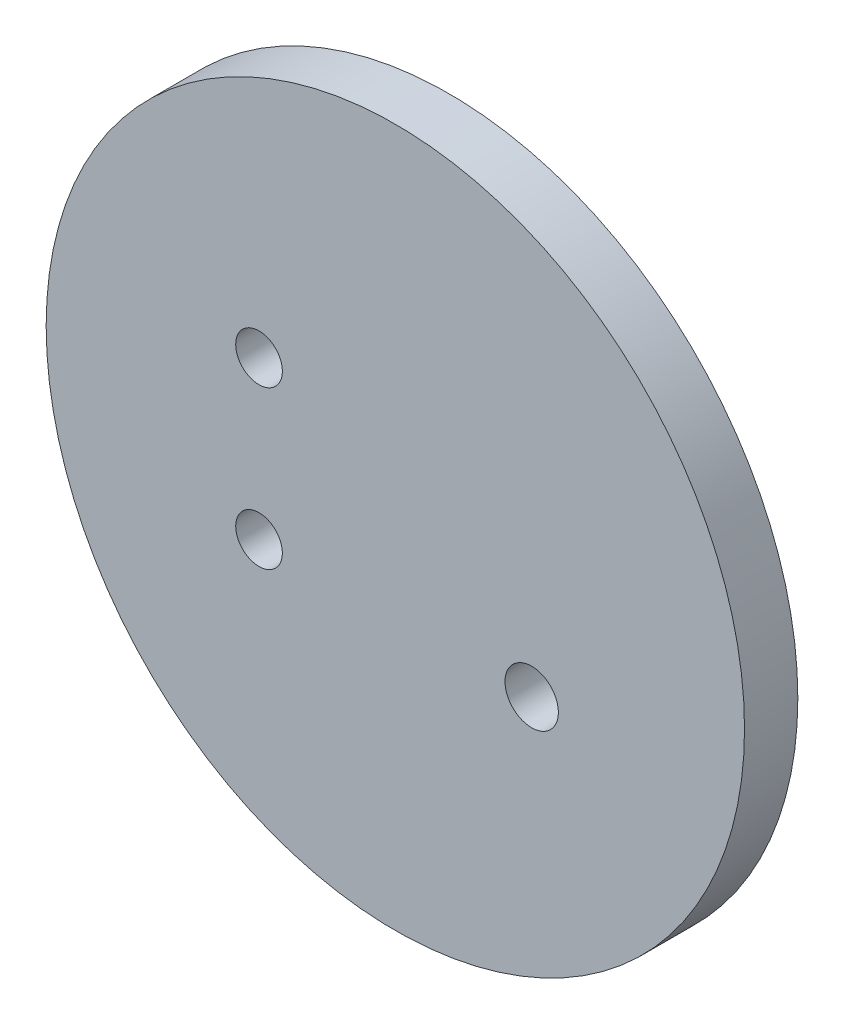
ISO-10303-21;
HEADER;
FILE_DESCRIPTION(('STEP AP214'),'2;1');
FILE_NAME('part.step','',(''),(''),'','','');
FILE_SCHEMA(('AUTOMOTIVE_DESIGN { 1 0 10303 214 1 1 1 1 }'));
ENDSEC;
DATA;
#1=APPLICATION_CONTEXT('core data for automotive mechanical design processes');
#2=APPLICATION_PROTOCOL_DEFINITION('international standard','automotive_design',2000,#1);
#3=PRODUCT_CONTEXT('',#1,'mechanical');
#4=PRODUCT('Part','Part','',(#3));
#5=PRODUCT_RELATED_PRODUCT_CATEGORY('part','',(#4));
#6=PRODUCT_DEFINITION_FORMATION('','',#4);
#7=PRODUCT_DEFINITION_CONTEXT('part definition',#1,'design');
#8=PRODUCT_DEFINITION('design','',#6,#7);
#9=PRODUCT_DEFINITION_SHAPE('','',#8);
#10=(LENGTH_UNIT() NAMED_UNIT(*) SI_UNIT(.MILLI.,.METRE.));
#11=(NAMED_UNIT(*) PLANE_ANGLE_UNIT() SI_UNIT($,.RADIAN.));
#12=(NAMED_UNIT(*) SI_UNIT($,.STERADIAN.) SOLID_ANGLE_UNIT());
#13=UNCERTAINTY_MEASURE_WITH_UNIT(LENGTH_MEASURE(1.E-05),#10,'distance_accuracy_value','');
#14=(GEOMETRIC_REPRESENTATION_CONTEXT(3) GLOBAL_UNCERTAINTY_ASSIGNED_CONTEXT((#13)) GLOBAL_UNIT_ASSIGNED_CONTEXT((#10,
#11,#12)) REPRESENTATION_CONTEXT('',''));
#15=CARTESIAN_POINT('',(0.,0.,0.));
#16=DIRECTION('',(0.,0.,1.));
#17=DIRECTION('',(1.,0.,0.));
#18=AXIS2_PLACEMENT_3D('',#15,#16,#17);
#19=CARTESIAN_POINT('',(2.08166817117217E-13,0.,28.1167999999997));
#20=DIRECTION('',(0.,0.,-0.99999999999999));
#21=DIRECTION('',(-0.999999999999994,0.,0.));
#22=AXIS2_PLACEMENT_3D('',#19,#20,#21);
#23=PLANE('',#22);
#24=CARTESIAN_POINT('',(32.4759526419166,-18.7499999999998,28.1167999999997));
#25=DIRECTION('',(0.,0.,-1.));
#26=DIRECTION('',(-1.,0.,0.));
#27=AXIS2_PLACEMENT_3D('',#24,#25,#26);
#28=CIRCLE('',#27,6.35);
#29=CARTESIAN_POINT('',(26.1259526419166,-18.7499999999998,28.1167999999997));
#30=VERTEX_POINT('',#29);
#31=EDGE_CURVE('E61',#30,#30,#28,.T.);
#32=ORIENTED_EDGE('',*,*,#31,.F.);
#33=EDGE_LOOP('',(#32));
#34=FACE_BOUND('',#33,.T.);
#35=CARTESIAN_POINT('',(-32.4759526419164,18.7500000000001,28.1167999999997));
#36=DIRECTION('',(0.,0.,-1.));
#37=DIRECTION('',(-1.,0.,0.));
#38=AXIS2_PLACEMENT_3D('',#35,#36,#37);
#39=CIRCLE('',#38,5.55625);
#40=CARTESIAN_POINT('',(-38.0322026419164,18.7500000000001,28.1167999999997));
#41=VERTEX_POINT('',#40);
#42=EDGE_CURVE('E53',#41,#41,#39,.T.);
#43=ORIENTED_EDGE('',*,*,#42,.F.);
#44=EDGE_LOOP('',(#43));
#45=FACE_BOUND('',#44,.T.);
#46=CARTESIAN_POINT('',(-32.4759526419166,-18.7499999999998,28.1167999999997));
#47=DIRECTION('',(0.,0.,-1.));
#48=DIRECTION('',(-1.,0.,0.));
#49=AXIS2_PLACEMENT_3D('',#46,#47,#48);
#50=CIRCLE('',#49,5.55625);
#51=CARTESIAN_POINT('',(-38.0322026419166,-18.7499999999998,28.1167999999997));
#52=VERTEX_POINT('',#51);
#53=EDGE_CURVE('E57',#52,#52,#50,.T.);
#54=ORIENTED_EDGE('',*,*,#53,.F.);
#55=EDGE_LOOP('',(#54));
#56=FACE_BOUND('',#55,.T.);
#57=CARTESIAN_POINT('',(0.,0.,28.1167999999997));
#58=DIRECTION('',(0.,0.,-0.99999999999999));
#59=DIRECTION('',(-0.999999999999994,0.,0.));
#60=AXIS2_PLACEMENT_3D('',#57,#58,#59);
#61=CIRCLE('',#60,83.185);
#62=CARTESIAN_POINT('',(-83.1849999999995,-5.35652633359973E-13,28.1167999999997));
#63=VERTEX_POINT('',#62);
#64=EDGE_CURVE('E11',#63,#63,#61,.T.);
#65=ORIENTED_EDGE('',*,*,#64,.T.);
#66=EDGE_LOOP('',(#65));
#67=FACE_BOUND('',#66,.T.);
#68=ADVANCED_FACE('F46',(#34,#45,#56,#67),#23,.T.);
#69=CARTESIAN_POINT('',(0.,0.,41.3168000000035));
#70=DIRECTION('',(0.,0.,-0.99999999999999));
#71=DIRECTION('',(-0.999999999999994,0.,0.));
#72=AXIS2_PLACEMENT_3D('',#69,#70,#71);
#73=CYLINDRICAL_SURFACE('',#72,83.185);
#74=CARTESIAN_POINT('',(0.,0.,40.8167999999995));
#75=DIRECTION('',(0.,0.,-0.99999999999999));
#76=DIRECTION('',(-1.,0.,0.));
#77=AXIS2_PLACEMENT_3D('',#74,#75,#76);
#78=CIRCLE('',#77,83.1849999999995);
#79=CARTESIAN_POINT('',(-83.1849999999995,-5.35652633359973E-13,40.8167999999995));
#80=VERTEX_POINT('',#79);
#81=EDGE_CURVE('E71',#80,#80,#78,.F.);
#82=CARTESIAN_POINT('',(-83.1849999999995,-5.35652633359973E-13,40.8167999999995));
#83=CARTESIAN_POINT('',(-83.1849999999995,-5.35652633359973E-13,40.6845083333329));
#84=CARTESIAN_POINT('',(-83.1849999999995,-5.35652633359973E-13,40.5522166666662));
#85=CARTESIAN_POINT('',(-83.1849999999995,-5.35652633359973E-13,40.2876333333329));
#86=CARTESIAN_POINT('',(-83.1849999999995,-5.35652633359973E-13,40.1553416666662));
#87=CARTESIAN_POINT('',(-83.1849999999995,-5.35652633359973E-13,39.8907583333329));
#88=CARTESIAN_POINT('',(-83.1849999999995,-5.35652633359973E-13,39.7584666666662));
#89=CARTESIAN_POINT('',(-83.1849999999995,-5.35652633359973E-13,39.4938833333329));
#90=CARTESIAN_POINT('',(-83.1849999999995,-5.35652633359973E-13,39.3615916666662));
#91=CARTESIAN_POINT('',(-83.1849999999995,-5.35652633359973E-13,39.0970083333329));
#92=CARTESIAN_POINT('',(-83.1849999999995,-5.35652633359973E-13,38.9647166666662));
#93=CARTESIAN_POINT('',(-83.1849999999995,-5.35652633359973E-13,38.7001333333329));
#94=CARTESIAN_POINT('',(-83.1849999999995,-5.35652633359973E-13,38.5678416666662));
#95=CARTESIAN_POINT('',(-83.1849999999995,-5.35652633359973E-13,38.3032583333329));
#96=CARTESIAN_POINT('',(-83.1849999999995,-5.35652633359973E-13,38.1709666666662));
#97=CARTESIAN_POINT('',(-83.1849999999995,-5.35652633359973E-13,37.9063833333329));
#98=CARTESIAN_POINT('',(-83.1849999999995,-5.35652633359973E-13,37.7740916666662));
#99=CARTESIAN_POINT('',(-83.1849999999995,-5.35652633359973E-13,37.5095083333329));
#100=CARTESIAN_POINT('',(-83.1849999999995,-5.35652633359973E-13,37.3772166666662));
#101=CARTESIAN_POINT('',(-83.1849999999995,-5.35652633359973E-13,37.1126333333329));
#102=CARTESIAN_POINT('',(-83.1849999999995,-5.35652633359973E-13,36.9803416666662));
#103=CARTESIAN_POINT('',(-83.1849999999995,-5.35652633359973E-13,36.7157583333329));
#104=CARTESIAN_POINT('',(-83.1849999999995,-5.35652633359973E-13,36.5834666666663));
#105=CARTESIAN_POINT('',(-83.1849999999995,-5.35652633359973E-13,36.3188833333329));
#106=CARTESIAN_POINT('',(-83.1849999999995,-5.35652633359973E-13,36.1865916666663));
#107=CARTESIAN_POINT('',(-83.1849999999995,-5.35652633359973E-13,35.9220083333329));
#108=CARTESIAN_POINT('',(-83.1849999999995,-5.35652633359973E-13,35.7897166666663));
#109=CARTESIAN_POINT('',(-83.1849999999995,-5.35652633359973E-13,35.5251333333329));
#110=CARTESIAN_POINT('',(-83.1849999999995,-5.35652633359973E-13,35.3928416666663));
#111=CARTESIAN_POINT('',(-83.1849999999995,-5.35652633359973E-13,35.1282583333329));
#112=CARTESIAN_POINT('',(-83.1849999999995,-5.35652633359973E-13,34.9959666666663));
#113=CARTESIAN_POINT('',(-83.1849999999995,-5.35652633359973E-13,34.7313833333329));
#114=CARTESIAN_POINT('',(-83.1849999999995,-5.35652633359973E-13,34.5990916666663));
#115=CARTESIAN_POINT('',(-83.1849999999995,-5.35652633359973E-13,34.3345083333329));
#116=CARTESIAN_POINT('',(-83.1849999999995,-5.35652633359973E-13,34.2022166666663));
#117=CARTESIAN_POINT('',(-83.1849999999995,-5.35652633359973E-13,33.9376333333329));
#118=CARTESIAN_POINT('',(-83.1849999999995,-5.35652633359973E-13,33.8053416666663));
#119=CARTESIAN_POINT('',(-83.1849999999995,-5.35652633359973E-13,33.5407583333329));
#120=CARTESIAN_POINT('',(-83.1849999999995,-5.35652633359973E-13,33.4084666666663));
#121=CARTESIAN_POINT('',(-83.1849999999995,-5.35652633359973E-13,33.143883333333));
#122=CARTESIAN_POINT('',(-83.1849999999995,-5.35652633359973E-13,33.0115916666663));
#123=CARTESIAN_POINT('',(-83.1849999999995,-5.35652633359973E-13,32.747008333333));
#124=CARTESIAN_POINT('',(-83.1849999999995,-5.35652633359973E-13,32.6147166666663));
#125=CARTESIAN_POINT('',(-83.1849999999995,-5.35652633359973E-13,32.350133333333));
#126=CARTESIAN_POINT('',(-83.1849999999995,-5.35652633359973E-13,32.2178416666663));
#127=CARTESIAN_POINT('',(-83.1849999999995,-5.35652633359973E-13,31.953258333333));
#128=CARTESIAN_POINT('',(-83.1849999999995,-5.35652633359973E-13,31.8209666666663));
#129=CARTESIAN_POINT('',(-83.1849999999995,-5.35652633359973E-13,31.556383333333));
#130=CARTESIAN_POINT('',(-83.1849999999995,-5.35652633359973E-13,31.4240916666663));
#131=CARTESIAN_POINT('',(-83.1849999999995,-5.35652633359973E-13,31.159508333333));
#132=CARTESIAN_POINT('',(-83.1849999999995,-5.35652633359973E-13,31.0272166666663));
#133=CARTESIAN_POINT('',(-83.1849999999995,-5.35652633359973E-13,30.762633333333));
#134=CARTESIAN_POINT('',(-83.1849999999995,-5.35652633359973E-13,30.6303416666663));
#135=CARTESIAN_POINT('',(-83.1849999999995,-5.35652633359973E-13,30.365758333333));
#136=CARTESIAN_POINT('',(-83.1849999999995,-5.35652633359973E-13,30.2334666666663));
#137=CARTESIAN_POINT('',(-83.1849999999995,-5.35652633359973E-13,29.968883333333));
#138=CARTESIAN_POINT('',(-83.1849999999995,-5.35652633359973E-13,29.8365916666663));
#139=CARTESIAN_POINT('',(-83.1849999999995,-5.35652633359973E-13,29.572008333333));
#140=CARTESIAN_POINT('',(-83.1849999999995,-5.35652633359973E-13,29.4397166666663));
#141=CARTESIAN_POINT('',(-83.1849999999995,-5.35652633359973E-13,29.175133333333));
#142=CARTESIAN_POINT('',(-83.1849999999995,-5.35652633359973E-13,29.0428416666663));
#143=CARTESIAN_POINT('',(-83.1849999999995,-5.35652633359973E-13,28.778258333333));
#144=CARTESIAN_POINT('',(-83.1849999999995,-5.35652633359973E-13,28.6459666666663));
#145=CARTESIAN_POINT('',(-83.1849999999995,-5.35652633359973E-13,28.381383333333));
#146=CARTESIAN_POINT('',(-83.1849999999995,-5.35652633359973E-13,28.2490916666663));
#147=CARTESIAN_POINT('',(-83.1849999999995,-5.35652633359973E-13,28.1167999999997));
#148=B_SPLINE_CURVE_WITH_KNOTS('',3,(#82,#83,#84,#85,#86,#87,#88,#89,#90,#91,#92,#93,#94,#95,
#96,#97,#98,#99,#100,#101,#102,#103,#104,#105,#106,#107,#108,#109,#110,#111,#112,#113,#114,#115,
#116,#117,#118,#119,#120,#121,#122,#123,#124,#125,#126,#127,#128,#129,#130,#131,#132,#133,#134,
#135,#136,#137,#138,#139,#140,#141,#142,#143,#144,#145,#146,#147),.UNSPECIFIED.,.F.,.F.,(4,2,2,
2,2,2,2,2,2,2,2,2,2,2,2,2,2,2,2,2,2,2,2,2,2,2,2,2,2,2,2,2,4),(0.,0.396874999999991,
0.793749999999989,1.19062499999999,1.58749999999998,1.98437499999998,2.38124999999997,
2.77812499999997,3.17499999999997,3.57187499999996,3.96874999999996,4.36562499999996,
4.76249999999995,5.15937499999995,5.55624999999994,5.95312499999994,6.34999999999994,
6.74687499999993,7.14374999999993,7.54062499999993,7.93749999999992,8.33437499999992,
8.73124999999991,9.12812499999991,9.52499999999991,9.9218749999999,10.3187499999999,
10.7156249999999,11.1124999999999,11.5093749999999,11.9062499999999,12.3031249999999,
12.6999999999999),.UNSPECIFIED.);
#149=EDGE_CURVE('BSEAM92',#80,#63,#148,.T.);
#150=ORIENTED_EDGE('',*,*,#81,.F.);
#151=ORIENTED_EDGE('',*,*,#64,.F.);
#152=ORIENTED_EDGE('',*,*,#149,.T.);
#153=ORIENTED_EDGE('',*,*,#149,.F.);
#154=EDGE_LOOP('',(#150,#152,#151,#153));
#155=FACE_BOUND('',#154,.T.);
#156=ADVANCED_FACE('F92',(#155),#73,.T.);
#157=CARTESIAN_POINT('',(-32.4759526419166,-18.7499999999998,57.0322482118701));
#158=DIRECTION('',(0.,0.,-0.999999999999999));
#159=DIRECTION('',(-1.,0.,0.));
#160=AXIS2_PLACEMENT_3D('',#157,#158,#159);
#161=CYLINDRICAL_SURFACE('',#160,5.55625);
#162=CARTESIAN_POINT('',(-32.4759526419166,-18.7499999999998,40.8167999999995));
#163=DIRECTION('',(0.,0.,-0.99999999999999));
#164=DIRECTION('',(-1.,0.,0.));
#165=AXIS2_PLACEMENT_3D('',#162,#163,#164);
#166=CIRCLE('',#165,5.55625);
#167=CARTESIAN_POINT('',(-38.0322026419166,-18.7499999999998,40.8167999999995));
#168=VERTEX_POINT('',#167);
#169=EDGE_CURVE('E65',#168,#168,#166,.F.);
#170=CARTESIAN_POINT('',(-38.0322026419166,-18.7499999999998,40.8167999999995));
#171=CARTESIAN_POINT('',(-38.0322026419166,-18.7499999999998,40.6845083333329));
#172=CARTESIAN_POINT('',(-38.0322026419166,-18.7499999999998,40.5522166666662));
#173=CARTESIAN_POINT('',(-38.0322026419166,-18.7499999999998,40.2876333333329));
#174=CARTESIAN_POINT('',(-38.0322026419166,-18.7499999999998,40.1553416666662));
#175=CARTESIAN_POINT('',(-38.0322026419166,-18.7499999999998,39.8907583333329));
#176=CARTESIAN_POINT('',(-38.0322026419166,-18.7499999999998,39.7584666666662));
#177=CARTESIAN_POINT('',(-38.0322026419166,-18.7499999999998,39.4938833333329));
#178=CARTESIAN_POINT('',(-38.0322026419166,-18.7499999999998,39.3615916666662));
#179=CARTESIAN_POINT('',(-38.0322026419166,-18.7499999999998,39.0970083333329));
#180=CARTESIAN_POINT('',(-38.0322026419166,-18.7499999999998,38.9647166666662));
#181=CARTESIAN_POINT('',(-38.0322026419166,-18.7499999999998,38.7001333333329));
#182=CARTESIAN_POINT('',(-38.0322026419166,-18.7499999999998,38.5678416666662));
#183=CARTESIAN_POINT('',(-38.0322026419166,-18.7499999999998,38.3032583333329));
#184=CARTESIAN_POINT('',(-38.0322026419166,-18.7499999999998,38.1709666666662));
#185=CARTESIAN_POINT('',(-38.0322026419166,-18.7499999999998,37.9063833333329));
#186=CARTESIAN_POINT('',(-38.0322026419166,-18.7499999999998,37.7740916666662));
#187=CARTESIAN_POINT('',(-38.0322026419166,-18.7499999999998,37.5095083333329));
#188=CARTESIAN_POINT('',(-38.0322026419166,-18.7499999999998,37.3772166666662));
#189=CARTESIAN_POINT('',(-38.0322026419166,-18.7499999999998,37.1126333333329));
#190=CARTESIAN_POINT('',(-38.0322026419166,-18.7499999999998,36.9803416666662));
#191=CARTESIAN_POINT('',(-38.0322026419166,-18.7499999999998,36.7157583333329));
#192=CARTESIAN_POINT('',(-38.0322026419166,-18.7499999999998,36.5834666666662));
#193=CARTESIAN_POINT('',(-38.0322026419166,-18.7499999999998,36.3188833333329));
#194=CARTESIAN_POINT('',(-38.0322026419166,-18.7499999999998,36.1865916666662));
#195=CARTESIAN_POINT('',(-38.0322026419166,-18.7499999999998,35.9220083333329));
#196=CARTESIAN_POINT('',(-38.0322026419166,-18.7499999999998,35.7897166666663));
#197=CARTESIAN_POINT('',(-38.0322026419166,-18.7499999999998,35.5251333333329));
#198=CARTESIAN_POINT('',(-38.0322026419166,-18.7499999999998,35.3928416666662));
#199=CARTESIAN_POINT('',(-38.0322026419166,-18.7499999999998,35.1282583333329));
#200=CARTESIAN_POINT('',(-38.0322026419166,-18.7499999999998,34.9959666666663));
#201=CARTESIAN_POINT('',(-38.0322026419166,-18.7499999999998,34.7313833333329));
#202=CARTESIAN_POINT('',(-38.0322026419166,-18.7499999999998,34.5990916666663));
#203=CARTESIAN_POINT('',(-38.0322026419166,-18.7499999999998,34.3345083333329));
#204=CARTESIAN_POINT('',(-38.0322026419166,-18.7499999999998,34.2022166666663));
#205=CARTESIAN_POINT('',(-38.0322026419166,-18.7499999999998,33.9376333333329));
#206=CARTESIAN_POINT('',(-38.0322026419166,-18.7499999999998,33.8053416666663));
#207=CARTESIAN_POINT('',(-38.0322026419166,-18.7499999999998,33.5407583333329));
#208=CARTESIAN_POINT('',(-38.0322026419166,-18.7499999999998,33.4084666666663));
#209=CARTESIAN_POINT('',(-38.0322026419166,-18.7499999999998,33.143883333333));
#210=CARTESIAN_POINT('',(-38.0322026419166,-18.7499999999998,33.0115916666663));
#211=CARTESIAN_POINT('',(-38.0322026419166,-18.7499999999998,32.7470083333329));
#212=CARTESIAN_POINT('',(-38.0322026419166,-18.7499999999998,32.6147166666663));
#213=CARTESIAN_POINT('',(-38.0322026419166,-18.7499999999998,32.350133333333));
#214=CARTESIAN_POINT('',(-38.0322026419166,-18.7499999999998,32.2178416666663));
#215=CARTESIAN_POINT('',(-38.0322026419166,-18.7499999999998,31.953258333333));
#216=CARTESIAN_POINT('',(-38.0322026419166,-18.7499999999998,31.8209666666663));
#217=CARTESIAN_POINT('',(-38.0322026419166,-18.7499999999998,31.556383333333));
#218=CARTESIAN_POINT('',(-38.0322026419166,-18.7499999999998,31.4240916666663));
#219=CARTESIAN_POINT('',(-38.0322026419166,-18.7499999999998,31.159508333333));
#220=CARTESIAN_POINT('',(-38.0322026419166,-18.7499999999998,31.0272166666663));
#221=CARTESIAN_POINT('',(-38.0322026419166,-18.7499999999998,30.762633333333));
#222=CARTESIAN_POINT('',(-38.0322026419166,-18.7499999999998,30.6303416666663));
#223=CARTESIAN_POINT('',(-38.0322026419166,-18.7499999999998,30.365758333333));
#224=CARTESIAN_POINT('',(-38.0322026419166,-18.7499999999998,30.2334666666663));
#225=CARTESIAN_POINT('',(-38.0322026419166,-18.7499999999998,29.968883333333));
#226=CARTESIAN_POINT('',(-38.0322026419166,-18.7499999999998,29.8365916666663));
#227=CARTESIAN_POINT('',(-38.0322026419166,-18.7499999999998,29.572008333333));
#228=CARTESIAN_POINT('',(-38.0322026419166,-18.7499999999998,29.4397166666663));
#229=CARTESIAN_POINT('',(-38.0322026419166,-18.7499999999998,29.175133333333));
#230=CARTESIAN_POINT('',(-38.0322026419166,-18.7499999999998,29.0428416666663));
#231=CARTESIAN_POINT('',(-38.0322026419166,-18.7499999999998,28.778258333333));
#232=CARTESIAN_POINT('',(-38.0322026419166,-18.7499999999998,28.6459666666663));
#233=CARTESIAN_POINT('',(-38.0322026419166,-18.7499999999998,28.381383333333));
#234=CARTESIAN_POINT('',(-38.0322026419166,-18.7499999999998,28.2490916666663));
#235=CARTESIAN_POINT('',(-38.0322026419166,-18.7499999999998,28.1167999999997));
#236=B_SPLINE_CURVE_WITH_KNOTS('',3,(#170,#171,#172,#173,#174,#175,#176,#177,#178,#179,#180,
#181,#182,#183,#184,#185,#186,#187,#188,#189,#190,#191,#192,#193,#194,#195,#196,#197,#198,#199,
#200,#201,#202,#203,#204,#205,#206,#207,#208,#209,#210,#211,#212,#213,#214,#215,#216,#217,#218,
#219,#220,#221,#222,#223,#224,#225,#226,#227,#228,#229,#230,#231,#232,#233,#234,#235),
.UNSPECIFIED.,.F.,.F.,(4,2,2,2,2,2,2,2,2,2,2,2,2,2,2,2,2,2,2,2,2,2,2,2,2,2,2,2,2,2,2,2,4),(0.,
0.396874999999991,0.793749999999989,1.19062499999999,1.58749999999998,1.98437499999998,
2.38124999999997,2.77812499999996,3.17499999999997,3.57187499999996,3.96874999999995,
4.36562499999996,4.76249999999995,5.15937499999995,5.55624999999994,5.95312499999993,
6.34999999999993,6.74687499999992,7.14374999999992,7.54062499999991,7.93749999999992,
8.33437499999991,8.73124999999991,9.1281249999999,9.5249999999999,9.92187499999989,
10.3187499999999,10.7156249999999,11.1124999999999,11.5093749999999,11.9062499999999,
12.3031249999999,12.6999999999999),.UNSPECIFIED.);
#237=EDGE_CURVE('BSEAM88',#168,#52,#236,.T.);
#238=ORIENTED_EDGE('',*,*,#169,.T.);
#239=ORIENTED_EDGE('',*,*,#53,.T.);
#240=ORIENTED_EDGE('',*,*,#237,.T.);
#241=ORIENTED_EDGE('',*,*,#237,.F.);
#242=EDGE_LOOP('',(#238,#240,#239,#241));
#243=FACE_BOUND('',#242,.T.);
#244=ADVANCED_FACE('F88',(#243),#161,.F.);
#245=CARTESIAN_POINT('',(-32.4759526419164,18.7500000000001,57.0322482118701));
#246=DIRECTION('',(0.,0.,-0.999999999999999));
#247=DIRECTION('',(-1.,0.,0.));
#248=AXIS2_PLACEMENT_3D('',#245,#246,#247);
#249=CYLINDRICAL_SURFACE('',#248,5.55625);
#250=CARTESIAN_POINT('',(-32.4759526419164,18.7500000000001,40.8167999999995));
#251=DIRECTION('',(0.,0.,-0.99999999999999));
#252=DIRECTION('',(-1.,0.,0.));
#253=AXIS2_PLACEMENT_3D('',#250,#251,#252);
#254=CIRCLE('',#253,5.55625);
#255=CARTESIAN_POINT('',(-38.0322026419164,18.7500000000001,40.8167999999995));
#256=VERTEX_POINT('',#255);
#257=EDGE_CURVE('E68',#256,#256,#254,.F.);
#258=CARTESIAN_POINT('',(-38.0322026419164,18.7500000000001,40.8167999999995));
#259=CARTESIAN_POINT('',(-38.0322026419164,18.7500000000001,40.6845083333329));
#260=CARTESIAN_POINT('',(-38.0322026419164,18.7500000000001,40.5522166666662));
#261=CARTESIAN_POINT('',(-38.0322026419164,18.7500000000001,40.2876333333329));
#262=CARTESIAN_POINT('',(-38.0322026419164,18.7500000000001,40.1553416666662));
#263=CARTESIAN_POINT('',(-38.0322026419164,18.7500000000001,39.8907583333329));
#264=CARTESIAN_POINT('',(-38.0322026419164,18.7500000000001,39.7584666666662));
#265=CARTESIAN_POINT('',(-38.0322026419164,18.7500000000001,39.4938833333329));
#266=CARTESIAN_POINT('',(-38.0322026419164,18.7500000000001,39.3615916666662));
#267=CARTESIAN_POINT('',(-38.0322026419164,18.7500000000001,39.0970083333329));
#268=CARTESIAN_POINT('',(-38.0322026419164,18.7500000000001,38.9647166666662));
#269=CARTESIAN_POINT('',(-38.0322026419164,18.7500000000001,38.7001333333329));
#270=CARTESIAN_POINT('',(-38.0322026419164,18.7500000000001,38.5678416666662));
#271=CARTESIAN_POINT('',(-38.0322026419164,18.7500000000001,38.3032583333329));
#272=CARTESIAN_POINT('',(-38.0322026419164,18.7500000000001,38.1709666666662));
#273=CARTESIAN_POINT('',(-38.0322026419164,18.7500000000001,37.9063833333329));
#274=CARTESIAN_POINT('',(-38.0322026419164,18.7500000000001,37.7740916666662));
#275=CARTESIAN_POINT('',(-38.0322026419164,18.7500000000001,37.5095083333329));
#276=CARTESIAN_POINT('',(-38.0322026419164,18.7500000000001,37.3772166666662));
#277=CARTESIAN_POINT('',(-38.0322026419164,18.7500000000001,37.1126333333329));
#278=CARTESIAN_POINT('',(-38.0322026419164,18.7500000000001,36.9803416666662));
#279=CARTESIAN_POINT('',(-38.0322026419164,18.7500000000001,36.7157583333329));
#280=CARTESIAN_POINT('',(-38.0322026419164,18.7500000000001,36.5834666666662));
#281=CARTESIAN_POINT('',(-38.0322026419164,18.7500000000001,36.3188833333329));
#282=CARTESIAN_POINT('',(-38.0322026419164,18.7500000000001,36.1865916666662));
#283=CARTESIAN_POINT('',(-38.0322026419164,18.7500000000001,35.9220083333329));
#284=CARTESIAN_POINT('',(-38.0322026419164,18.7500000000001,35.7897166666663));
#285=CARTESIAN_POINT('',(-38.0322026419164,18.7500000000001,35.5251333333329));
#286=CARTESIAN_POINT('',(-38.0322026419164,18.7500000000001,35.3928416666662));
#287=CARTESIAN_POINT('',(-38.0322026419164,18.7500000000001,35.1282583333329));
#288=CARTESIAN_POINT('',(-38.0322026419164,18.7500000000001,34.9959666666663));
#289=CARTESIAN_POINT('',(-38.0322026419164,18.7500000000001,34.7313833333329));
#290=CARTESIAN_POINT('',(-38.0322026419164,18.7500000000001,34.5990916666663));
#291=CARTESIAN_POINT('',(-38.0322026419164,18.7500000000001,34.3345083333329));
#292=CARTESIAN_POINT('',(-38.0322026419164,18.7500000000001,34.2022166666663));
#293=CARTESIAN_POINT('',(-38.0322026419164,18.7500000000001,33.9376333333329));
#294=CARTESIAN_POINT('',(-38.0322026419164,18.7500000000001,33.8053416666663));
#295=CARTESIAN_POINT('',(-38.0322026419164,18.7500000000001,33.5407583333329));
#296=CARTESIAN_POINT('',(-38.0322026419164,18.7500000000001,33.4084666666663));
#297=CARTESIAN_POINT('',(-38.0322026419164,18.7500000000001,33.143883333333));
#298=CARTESIAN_POINT('',(-38.0322026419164,18.7500000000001,33.0115916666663));
#299=CARTESIAN_POINT('',(-38.0322026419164,18.7500000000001,32.7470083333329));
#300=CARTESIAN_POINT('',(-38.0322026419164,18.7500000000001,32.6147166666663));
#301=CARTESIAN_POINT('',(-38.0322026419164,18.7500000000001,32.350133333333));
#302=CARTESIAN_POINT('',(-38.0322026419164,18.7500000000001,32.2178416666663));
#303=CARTESIAN_POINT('',(-38.0322026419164,18.7500000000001,31.953258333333));
#304=CARTESIAN_POINT('',(-38.0322026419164,18.7500000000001,31.8209666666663));
#305=CARTESIAN_POINT('',(-38.0322026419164,18.7500000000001,31.556383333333));
#306=CARTESIAN_POINT('',(-38.0322026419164,18.7500000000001,31.4240916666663));
#307=CARTESIAN_POINT('',(-38.0322026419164,18.7500000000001,31.159508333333));
#308=CARTESIAN_POINT('',(-38.0322026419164,18.7500000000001,31.0272166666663));
#309=CARTESIAN_POINT('',(-38.0322026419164,18.7500000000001,30.762633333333));
#310=CARTESIAN_POINT('',(-38.0322026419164,18.7500000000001,30.6303416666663));
#311=CARTESIAN_POINT('',(-38.0322026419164,18.7500000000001,30.365758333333));
#312=CARTESIAN_POINT('',(-38.0322026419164,18.7500000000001,30.2334666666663));
#313=CARTESIAN_POINT('',(-38.0322026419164,18.7500000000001,29.968883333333));
#314=CARTESIAN_POINT('',(-38.0322026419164,18.7500000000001,29.8365916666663));
#315=CARTESIAN_POINT('',(-38.0322026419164,18.7500000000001,29.572008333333));
#316=CARTESIAN_POINT('',(-38.0322026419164,18.7500000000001,29.4397166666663));
#317=CARTESIAN_POINT('',(-38.0322026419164,18.7500000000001,29.175133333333));
#318=CARTESIAN_POINT('',(-38.0322026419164,18.7500000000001,29.0428416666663));
#319=CARTESIAN_POINT('',(-38.0322026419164,18.7500000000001,28.778258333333));
#320=CARTESIAN_POINT('',(-38.0322026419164,18.7500000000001,28.6459666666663));
#321=CARTESIAN_POINT('',(-38.0322026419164,18.7500000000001,28.381383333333));
#322=CARTESIAN_POINT('',(-38.0322026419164,18.7500000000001,28.2490916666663));
#323=CARTESIAN_POINT('',(-38.0322026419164,18.7500000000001,28.1167999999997));
#324=B_SPLINE_CURVE_WITH_KNOTS('',3,(#258,#259,#260,#261,#262,#263,#264,#265,#266,#267,#268,
#269,#270,#271,#272,#273,#274,#275,#276,#277,#278,#279,#280,#281,#282,#283,#284,#285,#286,#287,
#288,#289,#290,#291,#292,#293,#294,#295,#296,#297,#298,#299,#300,#301,#302,#303,#304,#305,#306,
#307,#308,#309,#310,#311,#312,#313,#314,#315,#316,#317,#318,#319,#320,#321,#322,#323),
.UNSPECIFIED.,.F.,.F.,(4,2,2,2,2,2,2,2,2,2,2,2,2,2,2,2,2,2,2,2,2,2,2,2,2,2,2,2,2,2,2,2,4),(0.,
0.396874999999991,0.793749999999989,1.19062499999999,1.58749999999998,1.98437499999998,
2.38124999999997,2.77812499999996,3.17499999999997,3.57187499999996,3.96874999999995,
4.36562499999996,4.76249999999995,5.15937499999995,5.55624999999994,5.95312499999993,
6.34999999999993,6.74687499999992,7.14374999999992,7.54062499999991,7.93749999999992,
8.33437499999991,8.73124999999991,9.1281249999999,9.5249999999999,9.92187499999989,
10.3187499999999,10.7156249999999,11.1124999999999,11.5093749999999,11.9062499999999,
12.3031249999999,12.6999999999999),.UNSPECIFIED.);
#325=EDGE_CURVE('BSEAM91',#256,#41,#324,.T.);
#326=ORIENTED_EDGE('',*,*,#257,.T.);
#327=ORIENTED_EDGE('',*,*,#42,.T.);
#328=ORIENTED_EDGE('',*,*,#325,.T.);
#329=ORIENTED_EDGE('',*,*,#325,.F.);
#330=EDGE_LOOP('',(#326,#328,#327,#329));
#331=FACE_BOUND('',#330,.T.);
#332=ADVANCED_FACE('F91',(#331),#249,.F.);
#333=CARTESIAN_POINT('',(32.4759526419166,-18.7499999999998,41.3168000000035));
#334=DIRECTION('',(0.,0.,-1.));
#335=DIRECTION('',(-1.,0.,0.));
#336=AXIS2_PLACEMENT_3D('',#333,#334,#335);
#337=CYLINDRICAL_SURFACE('',#336,6.35);
#338=CARTESIAN_POINT('',(32.4759526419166,-18.7499999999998,40.8167999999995));
#339=DIRECTION('',(0.,0.,-0.99999999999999));
#340=DIRECTION('',(-1.,0.,0.));
#341=AXIS2_PLACEMENT_3D('',#338,#339,#340);
#342=CIRCLE('',#341,6.35);
#343=CARTESIAN_POINT('',(26.1259526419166,-18.7499999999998,40.8167999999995));
#344=VERTEX_POINT('',#343);
#345=EDGE_CURVE('E49',#344,#344,#342,.F.);
#346=ORIENTED_EDGE('',*,*,#345,.T.);
#347=EDGE_LOOP('',(#346));
#348=FACE_BOUND('',#347,.T.);
#349=ORIENTED_EDGE('',*,*,#31,.T.);
#350=EDGE_LOOP('',(#349));
#351=FACE_BOUND('',#350,.T.);
#352=ADVANCED_FACE('F78',(#348,#351),#337,.F.);
#353=CARTESIAN_POINT('',(2.08166817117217E-13,0.,40.8167999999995));
#354=DIRECTION('',(0.,0.,-0.99999999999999));
#355=DIRECTION('',(-0.999999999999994,0.,0.));
#356=AXIS2_PLACEMENT_3D('',#353,#354,#355);
#357=PLANE('',#356);
#358=ORIENTED_EDGE('',*,*,#257,.F.);
#359=EDGE_LOOP('',(#358));
#360=FACE_BOUND('',#359,.T.);
#361=ORIENTED_EDGE('',*,*,#81,.T.);
#362=EDGE_LOOP('',(#361));
#363=FACE_BOUND('',#362,.T.);
#364=ORIENTED_EDGE('',*,*,#345,.F.);
#365=EDGE_LOOP('',(#364));
#366=FACE_BOUND('',#365,.T.);
#367=ORIENTED_EDGE('',*,*,#169,.F.);
#368=EDGE_LOOP('',(#367));
#369=FACE_BOUND('',#368,.T.);
#370=ADVANCED_FACE('F81',(#360,#363,#366,#369),#357,.F.);
#371=CLOSED_SHELL('',(#68,#156,#244,#332,#352,#370));
#372=MANIFOLD_SOLID_BREP('B2',#371);
#373=ADVANCED_BREP_SHAPE_REPRESENTATION('',(#18,#372),#14);
#374=SHAPE_DEFINITION_REPRESENTATION(#9,#373);
ENDSEC;
END-ISO-10303-21;
